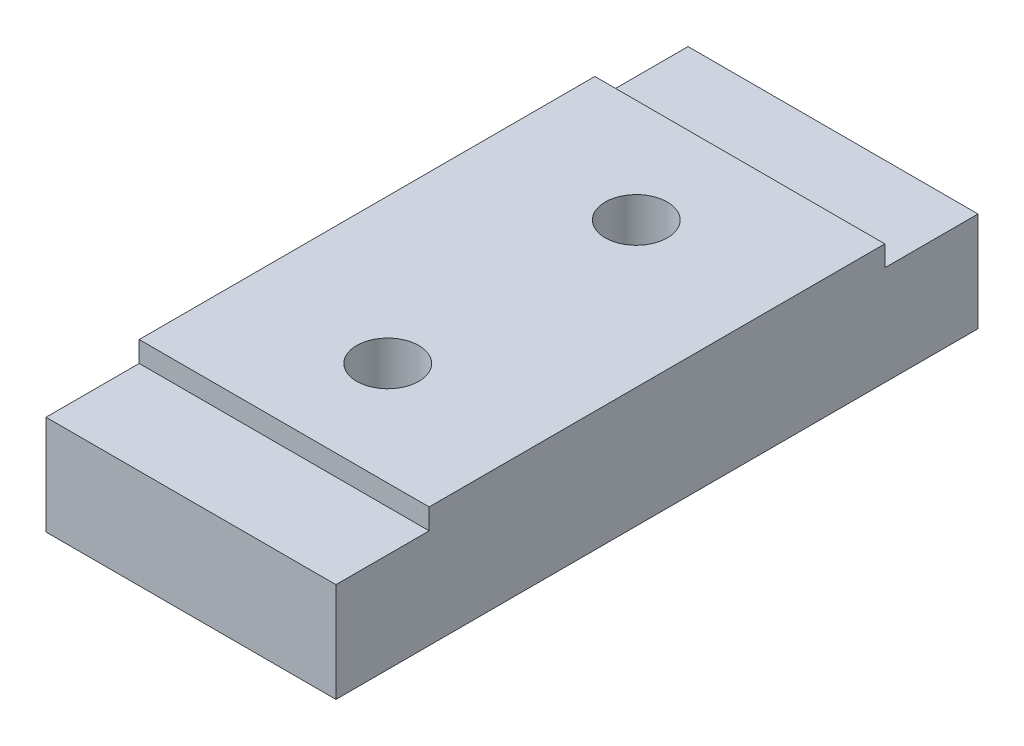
ISO-10303-21;
HEADER;
FILE_DESCRIPTION(('STEP AP214'),'2;1');
FILE_NAME('part.step','',(''),(''),'','','');
FILE_SCHEMA(('AUTOMOTIVE_DESIGN { 1 0 10303 214 1 1 1 1 }'));
ENDSEC;
DATA;
#1=APPLICATION_CONTEXT('core data for automotive mechanical design processes');
#2=APPLICATION_PROTOCOL_DEFINITION('international standard','automotive_design',2000,#1);
#3=PRODUCT_CONTEXT('',#1,'mechanical');
#4=PRODUCT('Part','Part','',(#3));
#5=PRODUCT_RELATED_PRODUCT_CATEGORY('part','',(#4));
#6=PRODUCT_DEFINITION_FORMATION('','',#4);
#7=PRODUCT_DEFINITION_CONTEXT('part definition',#1,'design');
#8=PRODUCT_DEFINITION('design','',#6,#7);
#9=PRODUCT_DEFINITION_SHAPE('','',#8);
#10=(LENGTH_UNIT() NAMED_UNIT(*) SI_UNIT(.MILLI.,.METRE.));
#11=(NAMED_UNIT(*) PLANE_ANGLE_UNIT() SI_UNIT($,.RADIAN.));
#12=(NAMED_UNIT(*) SI_UNIT($,.STERADIAN.) SOLID_ANGLE_UNIT());
#13=UNCERTAINTY_MEASURE_WITH_UNIT(LENGTH_MEASURE(1.E-05),#10,'distance_accuracy_value','');
#14=(GEOMETRIC_REPRESENTATION_CONTEXT(3) GLOBAL_UNCERTAINTY_ASSIGNED_CONTEXT((#13)) GLOBAL_UNIT_ASSIGNED_CONTEXT((#10,
#11,#12)) REPRESENTATION_CONTEXT('',''));
#15=CARTESIAN_POINT('',(0.,0.,0.));
#16=DIRECTION('',(0.,0.,1.));
#17=DIRECTION('',(1.,0.,0.));
#18=AXIS2_PLACEMENT_3D('',#15,#16,#17);
#19=CARTESIAN_POINT('',(-7.,9.,15.5));
#20=DIRECTION('',(1.,0.,0.));
#21=DIRECTION('',(0.,1.,0.));
#22=AXIS2_PLACEMENT_3D('',#19,#20,#21);
#23=PLANE('',#22);
#24=DIRECTION('',(0.,1.,0.));
#25=VECTOR('',#24,1.);
#26=CARTESIAN_POINT('',(-7.,8.,-11.));
#27=LINE('',#26,#25);
#28=CARTESIAN_POINT('',(-7.,8.,-11.));
#29=VERTEX_POINT('',#28);
#30=CARTESIAN_POINT('',(-7.,9.,-11.));
#31=VERTEX_POINT('',#30);
#32=EDGE_CURVE('E181',#29,#31,#27,.T.);
#33=ORIENTED_EDGE('',*,*,#32,.F.);
#34=DIRECTION('',(0.,0.,1.));
#35=VECTOR('',#34,1.);
#36=CARTESIAN_POINT('',(-7.,8.,15.5));
#37=LINE('',#36,#35);
#38=CARTESIAN_POINT('',(-7.,8.,-15.5));
#39=VERTEX_POINT('',#38);
#40=EDGE_CURVE('E178',#39,#29,#37,.T.);
#41=ORIENTED_EDGE('',*,*,#40,.F.);
#42=DIRECTION('',(0.,-1.,0.));
#43=VECTOR('',#42,1.);
#44=CARTESIAN_POINT('',(-7.,9.,-15.5));
#45=LINE('',#44,#43);
#46=CARTESIAN_POINT('',(-7.,3.2,-15.5));
#47=VERTEX_POINT('',#46);
#48=EDGE_CURVE('E131',#39,#47,#45,.T.);
#49=ORIENTED_EDGE('',*,*,#48,.T.);
#50=DIRECTION('',(0.,0.,-1.));
#51=VECTOR('',#50,1.);
#52=CARTESIAN_POINT('',(-7.,3.2,15.5));
#53=LINE('',#52,#51);
#54=CARTESIAN_POINT('',(-7.,3.2,15.5));
#55=VERTEX_POINT('',#54);
#56=EDGE_CURVE('E38',#55,#47,#53,.T.);
#57=ORIENTED_EDGE('',*,*,#56,.F.);
#58=DIRECTION('',(0.,-1.,0.));
#59=VECTOR('',#58,1.);
#60=CARTESIAN_POINT('',(-7.,9.,15.5));
#61=LINE('',#60,#59);
#62=CARTESIAN_POINT('',(-7.,8.,15.5));
#63=VERTEX_POINT('',#62);
#64=EDGE_CURVE('E163',#63,#55,#61,.T.);
#65=ORIENTED_EDGE('',*,*,#64,.F.);
#66=CARTESIAN_POINT('',(-7.,8.,11.));
#67=VERTEX_POINT('',#66);
#68=EDGE_CURVE('E45',#67,#63,#37,.T.);
#69=ORIENTED_EDGE('',*,*,#68,.F.);
#70=DIRECTION('',(0.,1.,0.));
#71=VECTOR('',#70,1.);
#72=CARTESIAN_POINT('',(-7.,8.,11.));
#73=LINE('',#72,#71);
#74=CARTESIAN_POINT('',(-7.,9.,11.));
#75=VERTEX_POINT('',#74);
#76=EDGE_CURVE('E106',#67,#75,#73,.T.);
#77=ORIENTED_EDGE('',*,*,#76,.T.);
#78=DIRECTION('',(0.,0.,-1.));
#79=VECTOR('',#78,1.);
#80=CARTESIAN_POINT('',(-7.,9.,15.5));
#81=LINE('',#80,#79);
#82=EDGE_CURVE('E115',#75,#31,#81,.T.);
#83=ORIENTED_EDGE('',*,*,#82,.T.);
#84=EDGE_LOOP('',(#33,#41,#49,#57,#65,#69,#77,#83));
#85=FACE_BOUND('',#84,.T.);
#86=ADVANCED_FACE('F31',(#85),#23,.F.);
#87=CARTESIAN_POINT('',(7.,9.,15.5));
#88=DIRECTION('',(-1.,0.,0.));
#89=DIRECTION('',(0.,-1.,0.));
#90=AXIS2_PLACEMENT_3D('',#87,#88,#89);
#91=PLANE('',#90);
#92=DIRECTION('',(0.,1.,0.));
#93=VECTOR('',#92,1.);
#94=CARTESIAN_POINT('',(7.,8.,-11.));
#95=LINE('',#94,#93);
#96=CARTESIAN_POINT('',(7.,8.,-11.));
#97=VERTEX_POINT('',#96);
#98=CARTESIAN_POINT('',(7.,9.,-11.));
#99=VERTEX_POINT('',#98);
#100=EDGE_CURVE('E105',#97,#99,#95,.T.);
#101=ORIENTED_EDGE('',*,*,#100,.T.);
#102=DIRECTION('',(0.,0.,-1.));
#103=VECTOR('',#102,1.);
#104=CARTESIAN_POINT('',(7.,9.,15.5));
#105=LINE('',#104,#103);
#106=CARTESIAN_POINT('',(7.,9.,11.));
#107=VERTEX_POINT('',#106);
#108=EDGE_CURVE('E113',#107,#99,#105,.T.);
#109=ORIENTED_EDGE('',*,*,#108,.F.);
#110=DIRECTION('',(0.,1.,0.));
#111=VECTOR('',#110,1.);
#112=CARTESIAN_POINT('',(7.,8.,11.));
#113=LINE('',#112,#111);
#114=CARTESIAN_POINT('',(7.,8.,11.));
#115=VERTEX_POINT('',#114);
#116=EDGE_CURVE('E96',#115,#107,#113,.T.);
#117=ORIENTED_EDGE('',*,*,#116,.F.);
#118=DIRECTION('',(0.,0.,-1.));
#119=VECTOR('',#118,1.);
#120=CARTESIAN_POINT('',(7.,8.,15.5));
#121=LINE('',#120,#119);
#122=CARTESIAN_POINT('',(7.,8.,15.5));
#123=VERTEX_POINT('',#122);
#124=EDGE_CURVE('E175',#123,#115,#121,.T.);
#125=ORIENTED_EDGE('',*,*,#124,.F.);
#126=DIRECTION('',(0.,1.,0.));
#127=VECTOR('',#126,1.);
#128=CARTESIAN_POINT('',(7.,9.,15.5));
#129=LINE('',#128,#127);
#130=CARTESIAN_POINT('',(7.,3.2,15.5));
#131=VERTEX_POINT('',#130);
#132=EDGE_CURVE('E123',#131,#123,#129,.T.);
#133=ORIENTED_EDGE('',*,*,#132,.F.);
#134=DIRECTION('',(0.,0.,-1.));
#135=VECTOR('',#134,1.);
#136=CARTESIAN_POINT('',(7.,3.2,15.5));
#137=LINE('',#136,#135);
#138=CARTESIAN_POINT('',(7.,3.2,-15.5));
#139=VERTEX_POINT('',#138);
#140=EDGE_CURVE('E120',#131,#139,#137,.T.);
#141=ORIENTED_EDGE('',*,*,#140,.T.);
#142=DIRECTION('',(0.,1.,0.));
#143=VECTOR('',#142,1.);
#144=CARTESIAN_POINT('',(7.,9.,-15.5));
#145=LINE('',#144,#143);
#146=CARTESIAN_POINT('',(7.,8.,-15.5));
#147=VERTEX_POINT('',#146);
#148=EDGE_CURVE('E160',#139,#147,#145,.T.);
#149=ORIENTED_EDGE('',*,*,#148,.T.);
#150=EDGE_CURVE('E52',#97,#147,#121,.T.);
#151=ORIENTED_EDGE('',*,*,#150,.F.);
#152=EDGE_LOOP('',(#101,#109,#117,#125,#133,#141,#149,#151));
#153=FACE_BOUND('',#152,.T.);
#154=ADVANCED_FACE('F119',(#153),#91,.F.);
#155=CARTESIAN_POINT('',(-7.,9.,15.5));
#156=DIRECTION('',(0.,-1.,0.));
#157=DIRECTION('',(0.,0.,-1.));
#158=AXIS2_PLACEMENT_3D('',#155,#156,#157);
#159=PLANE('',#158);
#160=CARTESIAN_POINT('',(0.,9.,-6.));
#161=DIRECTION('',(0.,1.,0.));
#162=DIRECTION('',(0.,0.,1.));
#163=AXIS2_PLACEMENT_3D('',#160,#161,#162);
#164=CIRCLE('',#163,1.5);
#165=CARTESIAN_POINT('',(0.,9.,-4.5));
#166=VERTEX_POINT('',#165);
#167=EDGE_CURVE('E136',#166,#166,#164,.T.);
#168=ORIENTED_EDGE('',*,*,#167,.F.);
#169=EDGE_LOOP('',(#168));
#170=FACE_BOUND('',#169,.T.);
#171=CARTESIAN_POINT('',(0.,9.,6.));
#172=DIRECTION('',(0.,1.,0.));
#173=DIRECTION('',(0.,0.,1.));
#174=AXIS2_PLACEMENT_3D('',#171,#172,#173);
#175=CIRCLE('',#174,1.5);
#176=CARTESIAN_POINT('',(0.,9.,7.5));
#177=VERTEX_POINT('',#176);
#178=EDGE_CURVE('E132',#177,#177,#175,.T.);
#179=ORIENTED_EDGE('',*,*,#178,.F.);
#180=EDGE_LOOP('',(#179));
#181=FACE_BOUND('',#180,.T.);
#182=DIRECTION('',(-1.,0.,0.));
#183=VECTOR('',#182,1.);
#184=CARTESIAN_POINT('',(-7.,9.,-11.));
#185=LINE('',#184,#183);
#186=EDGE_CURVE('E116',#99,#31,#185,.T.);
#187=ORIENTED_EDGE('',*,*,#186,.T.);
#188=ORIENTED_EDGE('',*,*,#82,.F.);
#189=DIRECTION('',(1.,0.,0.));
#190=VECTOR('',#189,1.);
#191=CARTESIAN_POINT('',(-7.,9.,11.));
#192=LINE('',#191,#190);
#193=EDGE_CURVE('E99',#75,#107,#192,.T.);
#194=ORIENTED_EDGE('',*,*,#193,.T.);
#195=ORIENTED_EDGE('',*,*,#108,.T.);
#196=EDGE_LOOP('',(#187,#188,#194,#195));
#197=FACE_BOUND('',#196,.T.);
#198=ADVANCED_FACE('F112',(#170,#181,#197),#159,.F.);
#199=CARTESIAN_POINT('',(-7.,3.2,15.5));
#200=DIRECTION('',(0.,0.,1.));
#201=DIRECTION('',(1.,0.,0.));
#202=AXIS2_PLACEMENT_3D('',#199,#200,#201);
#203=PLANE('',#202);
#204=ORIENTED_EDGE('',*,*,#132,.T.);
#205=DIRECTION('',(-1.,0.,0.));
#206=VECTOR('',#205,1.);
#207=CARTESIAN_POINT('',(-7.,8.,15.5));
#208=LINE('',#207,#206);
#209=EDGE_CURVE('E170',#123,#63,#208,.T.);
#210=ORIENTED_EDGE('',*,*,#209,.T.);
#211=ORIENTED_EDGE('',*,*,#64,.T.);
#212=DIRECTION('',(1.,0.,0.));
#213=VECTOR('',#212,1.);
#214=CARTESIAN_POINT('',(-7.,3.2,15.5));
#215=LINE('',#214,#213);
#216=EDGE_CURVE('E165',#55,#131,#215,.T.);
#217=ORIENTED_EDGE('',*,*,#216,.T.);
#218=EDGE_LOOP('',(#204,#210,#211,#217));
#219=FACE_BOUND('',#218,.T.);
#220=ADVANCED_FACE('F169',(#219),#203,.T.);
#221=CARTESIAN_POINT('',(-7.,3.2,-15.5));
#222=DIRECTION('',(0.,0.,1.));
#223=DIRECTION('',(1.,0.,0.));
#224=AXIS2_PLACEMENT_3D('',#221,#222,#223);
#225=PLANE('',#224);
#226=DIRECTION('',(-1.,0.,0.));
#227=VECTOR('',#226,1.);
#228=CARTESIAN_POINT('',(-7.,8.,-15.5));
#229=LINE('',#228,#227);
#230=EDGE_CURVE('E12',#147,#39,#229,.T.);
#231=ORIENTED_EDGE('',*,*,#230,.F.);
#232=ORIENTED_EDGE('',*,*,#148,.F.);
#233=DIRECTION('',(1.,0.,0.));
#234=VECTOR('',#233,1.);
#235=CARTESIAN_POINT('',(-7.,3.2,-15.5));
#236=LINE('',#235,#234);
#237=EDGE_CURVE('E157',#47,#139,#236,.T.);
#238=ORIENTED_EDGE('',*,*,#237,.F.);
#239=ORIENTED_EDGE('',*,*,#48,.F.);
#240=EDGE_LOOP('',(#231,#232,#238,#239));
#241=FACE_BOUND('',#240,.T.);
#242=ADVANCED_FACE('F197',(#241),#225,.F.);
#243=CARTESIAN_POINT('',(-7.,3.2,15.5));
#244=DIRECTION('',(0.,1.,0.));
#245=DIRECTION('',(0.,0.,1.));
#246=AXIS2_PLACEMENT_3D('',#243,#244,#245);
#247=PLANE('',#246);
#248=CARTESIAN_POINT('',(0.,3.2,-6.));
#249=DIRECTION('',(0.,1.,0.));
#250=DIRECTION('',(0.,0.,1.));
#251=AXIS2_PLACEMENT_3D('',#248,#249,#250);
#252=CIRCLE('',#251,1.25);
#253=CARTESIAN_POINT('',(0.,3.2,-4.75));
#254=VERTEX_POINT('',#253);
#255=EDGE_CURVE('E133',#254,#254,#252,.T.);
#256=ORIENTED_EDGE('',*,*,#255,.T.);
#257=EDGE_LOOP('',(#256));
#258=FACE_BOUND('',#257,.T.);
#259=CARTESIAN_POINT('',(0.,3.2,6.));
#260=DIRECTION('',(0.,1.,0.));
#261=DIRECTION('',(0.,0.,1.));
#262=AXIS2_PLACEMENT_3D('',#259,#260,#261);
#263=CIRCLE('',#262,1.25);
#264=CARTESIAN_POINT('',(0.,3.2,7.25));
#265=VERTEX_POINT('',#264);
#266=EDGE_CURVE('E129',#265,#265,#263,.T.);
#267=ORIENTED_EDGE('',*,*,#266,.T.);
#268=EDGE_LOOP('',(#267));
#269=FACE_BOUND('',#268,.T.);
#270=ORIENTED_EDGE('',*,*,#56,.T.);
#271=ORIENTED_EDGE('',*,*,#237,.T.);
#272=ORIENTED_EDGE('',*,*,#140,.F.);
#273=ORIENTED_EDGE('',*,*,#216,.F.);
#274=EDGE_LOOP('',(#270,#271,#272,#273));
#275=FACE_BOUND('',#274,.T.);
#276=ADVANCED_FACE('F199',(#258,#269,#275),#247,.F.);
#277=CARTESIAN_POINT('',(0.,9.,6.));
#278=DIRECTION('',(0.,1.,0.));
#279=DIRECTION('',(0.,0.,1.));
#280=AXIS2_PLACEMENT_3D('',#277,#278,#279);
#281=CYLINDRICAL_SURFACE('',#280,1.25);
#282=CARTESIAN_POINT('',(0.,4.,6.));
#283=DIRECTION('',(0.,1.,0.));
#284=DIRECTION('',(0.,0.,1.));
#285=AXIS2_PLACEMENT_3D('',#282,#283,#284);
#286=CIRCLE('',#285,1.25);
#287=CARTESIAN_POINT('',(0.,4.,7.25));
#288=VERTEX_POINT('',#287);
#289=EDGE_CURVE('E135',#288,#288,#286,.T.);
#290=ORIENTED_EDGE('',*,*,#289,.T.);
#291=EDGE_LOOP('',(#290));
#292=FACE_BOUND('',#291,.T.);
#293=ORIENTED_EDGE('',*,*,#266,.F.);
#294=EDGE_LOOP('',(#293));
#295=FACE_BOUND('',#294,.T.);
#296=ADVANCED_FACE('F201',(#292,#295),#281,.F.);
#297=CARTESIAN_POINT('',(0.,9.,6.));
#298=DIRECTION('',(0.,1.,0.));
#299=DIRECTION('',(0.,0.,1.));
#300=AXIS2_PLACEMENT_3D('',#297,#298,#299);
#301=CYLINDRICAL_SURFACE('',#300,1.5);
#302=CARTESIAN_POINT('',(0.,4.,6.));
#303=DIRECTION('',(0.,1.,0.));
#304=DIRECTION('',(0.,0.,1.));
#305=AXIS2_PLACEMENT_3D('',#302,#303,#304);
#306=CIRCLE('',#305,1.5);
#307=CARTESIAN_POINT('',(0.,4.,7.5));
#308=VERTEX_POINT('',#307);
#309=EDGE_CURVE('E140',#308,#308,#306,.T.);
#310=ORIENTED_EDGE('',*,*,#309,.F.);
#311=EDGE_LOOP('',(#310));
#312=FACE_BOUND('',#311,.T.);
#313=ORIENTED_EDGE('',*,*,#178,.T.);
#314=EDGE_LOOP('',(#313));
#315=FACE_BOUND('',#314,.T.);
#316=ADVANCED_FACE('F206',(#312,#315),#301,.F.);
#317=CARTESIAN_POINT('',(1.25,4.,6.));
#318=DIRECTION('',(0.,-1.,0.));
#319=DIRECTION('',(0.,0.,-1.));
#320=AXIS2_PLACEMENT_3D('',#317,#318,#319);
#321=PLANE('',#320);
#322=ORIENTED_EDGE('',*,*,#289,.F.);
#323=EDGE_LOOP('',(#322));
#324=FACE_BOUND('',#323,.T.);
#325=ORIENTED_EDGE('',*,*,#309,.T.);
#326=EDGE_LOOP('',(#325));
#327=FACE_BOUND('',#326,.T.);
#328=ADVANCED_FACE('F226',(#324,#327),#321,.F.);
#329=CARTESIAN_POINT('',(0.,9.,-6.));
#330=DIRECTION('',(0.,1.,0.));
#331=DIRECTION('',(0.,0.,1.));
#332=AXIS2_PLACEMENT_3D('',#329,#330,#331);
#333=CYLINDRICAL_SURFACE('',#332,1.25);
#334=CARTESIAN_POINT('',(0.,4.,-6.));
#335=DIRECTION('',(0.,1.,0.));
#336=DIRECTION('',(0.,0.,1.));
#337=AXIS2_PLACEMENT_3D('',#334,#335,#336);
#338=CIRCLE('',#337,1.25);
#339=CARTESIAN_POINT('',(0.,4.,-4.75));
#340=VERTEX_POINT('',#339);
#341=EDGE_CURVE('E148',#340,#340,#338,.T.);
#342=ORIENTED_EDGE('',*,*,#341,.T.);
#343=EDGE_LOOP('',(#342));
#344=FACE_BOUND('',#343,.T.);
#345=ORIENTED_EDGE('',*,*,#255,.F.);
#346=EDGE_LOOP('',(#345));
#347=FACE_BOUND('',#346,.T.);
#348=ADVANCED_FACE('F229',(#344,#347),#333,.F.);
#349=CARTESIAN_POINT('',(0.,9.,-6.));
#350=DIRECTION('',(0.,1.,0.));
#351=DIRECTION('',(0.,0.,1.));
#352=AXIS2_PLACEMENT_3D('',#349,#350,#351);
#353=CYLINDRICAL_SURFACE('',#352,1.5);
#354=CARTESIAN_POINT('',(0.,4.,-6.));
#355=DIRECTION('',(0.,1.,0.));
#356=DIRECTION('',(0.,0.,1.));
#357=AXIS2_PLACEMENT_3D('',#354,#355,#356);
#358=CIRCLE('',#357,1.5);
#359=CARTESIAN_POINT('',(0.,4.,-4.5));
#360=VERTEX_POINT('',#359);
#361=EDGE_CURVE('E143',#360,#360,#358,.T.);
#362=ORIENTED_EDGE('',*,*,#361,.F.);
#363=EDGE_LOOP('',(#362));
#364=FACE_BOUND('',#363,.T.);
#365=ORIENTED_EDGE('',*,*,#167,.T.);
#366=EDGE_LOOP('',(#365));
#367=FACE_BOUND('',#366,.T.);
#368=ADVANCED_FACE('F232',(#364,#367),#353,.F.);
#369=CARTESIAN_POINT('',(1.25,4.,-6.));
#370=DIRECTION('',(0.,-1.,0.));
#371=DIRECTION('',(0.,0.,-1.));
#372=AXIS2_PLACEMENT_3D('',#369,#370,#371);
#373=PLANE('',#372);
#374=ORIENTED_EDGE('',*,*,#341,.F.);
#375=EDGE_LOOP('',(#374));
#376=FACE_BOUND('',#375,.T.);
#377=ORIENTED_EDGE('',*,*,#361,.T.);
#378=EDGE_LOOP('',(#377));
#379=FACE_BOUND('',#378,.T.);
#380=ADVANCED_FACE('F235',(#376,#379),#373,.F.);
#381=CARTESIAN_POINT('',(0.,8.,0.));
#382=DIRECTION('',(0.,1.,0.));
#383=DIRECTION('',(0.,0.,1.));
#384=AXIS2_PLACEMENT_3D('',#381,#382,#383);
#385=PLANE('',#384);
#386=ORIENTED_EDGE('',*,*,#40,.T.);
#387=DIRECTION('',(-1.,0.,0.));
#388=VECTOR('',#387,1.);
#389=CARTESIAN_POINT('',(-7.,8.,-11.));
#390=LINE('',#389,#388);
#391=EDGE_CURVE('E188',#97,#29,#390,.T.);
#392=ORIENTED_EDGE('',*,*,#391,.F.);
#393=ORIENTED_EDGE('',*,*,#150,.T.);
#394=ORIENTED_EDGE('',*,*,#230,.T.);
#395=EDGE_LOOP('',(#386,#392,#393,#394));
#396=FACE_BOUND('',#395,.T.);
#397=ADVANCED_FACE('F239',(#396),#385,.T.);
#398=CARTESIAN_POINT('',(-7.,8.,-11.));
#399=DIRECTION('',(0.,0.,-1.));
#400=DIRECTION('',(-1.,0.,0.));
#401=AXIS2_PLACEMENT_3D('',#398,#399,#400);
#402=PLANE('',#401);
#403=ORIENTED_EDGE('',*,*,#186,.F.);
#404=ORIENTED_EDGE('',*,*,#100,.F.);
#405=ORIENTED_EDGE('',*,*,#391,.T.);
#406=ORIENTED_EDGE('',*,*,#32,.T.);
#407=EDGE_LOOP('',(#403,#404,#405,#406));
#408=FACE_BOUND('',#407,.T.);
#409=ADVANCED_FACE('F247',(#408),#402,.T.);
#410=ORIENTED_EDGE('',*,*,#68,.T.);
#411=ORIENTED_EDGE('',*,*,#209,.F.);
#412=ORIENTED_EDGE('',*,*,#124,.T.);
#413=DIRECTION('',(1.,0.,0.));
#414=VECTOR('',#413,1.);
#415=CARTESIAN_POINT('',(-7.,8.,11.));
#416=LINE('',#415,#414);
#417=EDGE_CURVE('E101',#67,#115,#416,.T.);
#418=ORIENTED_EDGE('',*,*,#417,.F.);
#419=EDGE_LOOP('',(#410,#411,#412,#418));
#420=FACE_BOUND('',#419,.T.);
#421=ADVANCED_FACE('F244',(#420),#385,.T.);
#422=CARTESIAN_POINT('',(-7.,8.,11.));
#423=DIRECTION('',(0.,0.,1.));
#424=DIRECTION('',(1.,0.,0.));
#425=AXIS2_PLACEMENT_3D('',#422,#423,#424);
#426=PLANE('',#425);
#427=ORIENTED_EDGE('',*,*,#193,.F.);
#428=ORIENTED_EDGE('',*,*,#76,.F.);
#429=ORIENTED_EDGE('',*,*,#417,.T.);
#430=ORIENTED_EDGE('',*,*,#116,.T.);
#431=EDGE_LOOP('',(#427,#428,#429,#430));
#432=FACE_BOUND('',#431,.T.);
#433=ADVANCED_FACE('F98',(#432),#426,.T.);
#434=CLOSED_SHELL('',(#86,#154,#198,#220,#242,#276,#296,#316,#328,#348,#368,#380,#397,#409,#421,#433));
#435=MANIFOLD_SOLID_BREP('B2',#434);
#436=ADVANCED_BREP_SHAPE_REPRESENTATION('',(#18,#435),#14);
#437=SHAPE_DEFINITION_REPRESENTATION(#9,#436);
ENDSEC;
END-ISO-10303-21;
